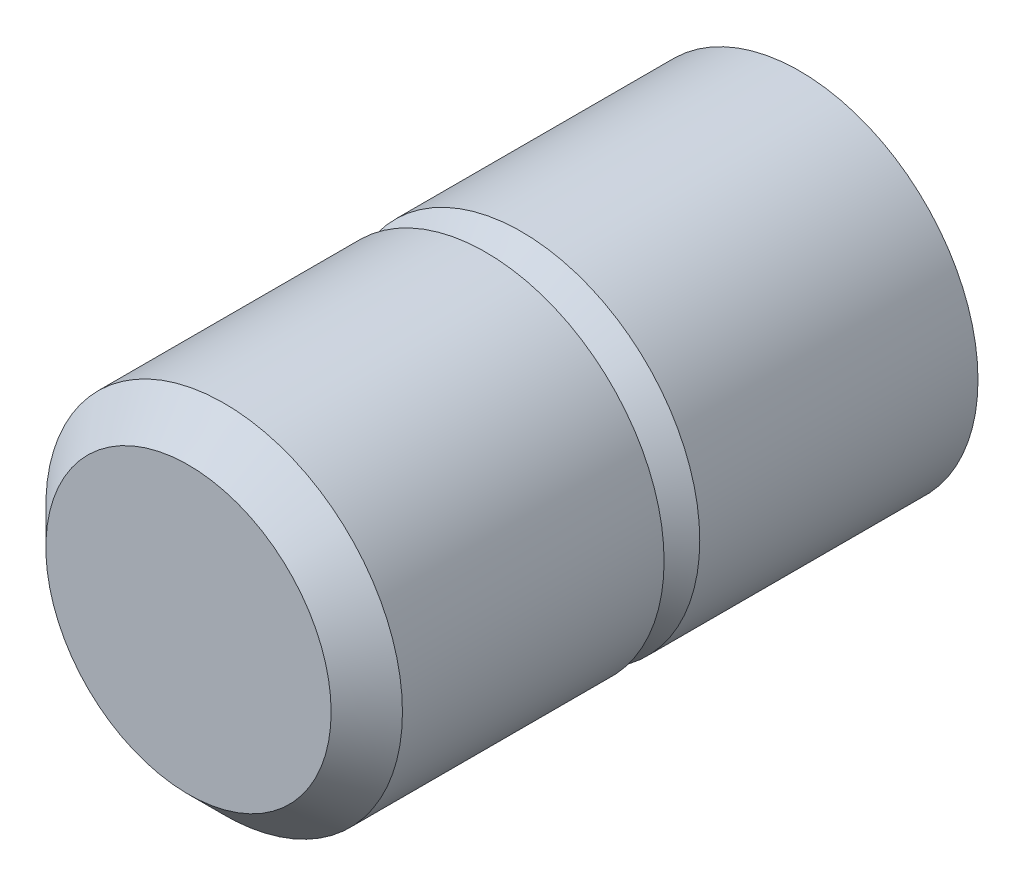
ISO-10303-21;
HEADER;
FILE_DESCRIPTION(('STEP AP214'),'2;1');
FILE_NAME('part.step','',(''),(''),'','','');
FILE_SCHEMA(('AUTOMOTIVE_DESIGN { 1 0 10303 214 1 1 1 1 }'));
ENDSEC;
DATA;
#1=APPLICATION_CONTEXT('core data for automotive mechanical design processes');
#2=APPLICATION_PROTOCOL_DEFINITION('international standard','automotive_design',2000,#1);
#3=PRODUCT_CONTEXT('',#1,'mechanical');
#4=PRODUCT('Part','Part','',(#3));
#5=PRODUCT_RELATED_PRODUCT_CATEGORY('part','',(#4));
#6=PRODUCT_DEFINITION_FORMATION('','',#4);
#7=PRODUCT_DEFINITION_CONTEXT('part definition',#1,'design');
#8=PRODUCT_DEFINITION('design','',#6,#7);
#9=PRODUCT_DEFINITION_SHAPE('','',#8);
#10=(LENGTH_UNIT() NAMED_UNIT(*) SI_UNIT(.MILLI.,.METRE.));
#11=(NAMED_UNIT(*) PLANE_ANGLE_UNIT() SI_UNIT($,.RADIAN.));
#12=(NAMED_UNIT(*) SI_UNIT($,.STERADIAN.) SOLID_ANGLE_UNIT());
#13=UNCERTAINTY_MEASURE_WITH_UNIT(LENGTH_MEASURE(1.E-05),#10,'distance_accuracy_value','');
#14=(GEOMETRIC_REPRESENTATION_CONTEXT(3) GLOBAL_UNCERTAINTY_ASSIGNED_CONTEXT((#13)) GLOBAL_UNIT_ASSIGNED_CONTEXT((#10,
#11,#12)) REPRESENTATION_CONTEXT('',''));
#15=CARTESIAN_POINT('',(0.,0.,0.));
#16=DIRECTION('',(0.,0.,1.));
#17=DIRECTION('',(1.,0.,0.));
#18=AXIS2_PLACEMENT_3D('',#15,#16,#17);
#19=CARTESIAN_POINT('',(0.,0.,0.));
#20=DIRECTION('',(0.,0.,-1.));
#21=DIRECTION('',(-1.,0.,0.));
#22=AXIS2_PLACEMENT_3D('',#19,#20,#21);
#23=PLANE('',#22);
#24=CARTESIAN_POINT('',(0.,0.,0.));
#25=DIRECTION('',(0.,0.,1.));
#26=DIRECTION('',(1.,0.,0.));
#27=AXIS2_PLACEMENT_3D('',#24,#25,#26);
#28=CIRCLE('',#27,4.801616);
#29=CARTESIAN_POINT('',(4.801616,0.,0.));
#30=VERTEX_POINT('',#29);
#31=EDGE_CURVE('E10',#30,#30,#28,.T.);
#32=ORIENTED_EDGE('',*,*,#31,.T.);
#33=EDGE_LOOP('',(#32));
#34=FACE_BOUND('',#33,.T.);
#35=ADVANCED_FACE('F29',(#34),#23,.F.);
#36=CARTESIAN_POINT('',(0.,0.,-1.200404));
#37=DIRECTION('',(0.,0.,-1.));
#38=DIRECTION('',(-1.,0.,0.));
#39=AXIS2_PLACEMENT_3D('',#36,#37,#38);
#40=CONICAL_SURFACE('',#39,6.00202,0.785398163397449);
#41=ORIENTED_EDGE('',*,*,#31,.F.);
#42=EDGE_LOOP('',(#41));
#43=FACE_BOUND('',#42,.T.);
#44=CARTESIAN_POINT('',(0.,0.,-1.200404));
#45=DIRECTION('',(0.,0.,1.));
#46=DIRECTION('',(1.,0.,0.));
#47=AXIS2_PLACEMENT_3D('',#44,#45,#46);
#48=CIRCLE('',#47,6.00202);
#49=CARTESIAN_POINT('',(6.00202,0.,-1.200404));
#50=VERTEX_POINT('',#49);
#51=EDGE_CURVE('E35',#50,#50,#48,.T.);
#52=ORIENTED_EDGE('',*,*,#51,.T.);
#53=EDGE_LOOP('',(#52));
#54=FACE_BOUND('',#53,.T.);
#55=ADVANCED_FACE('F67',(#43,#54),#40,.T.);
#56=CARTESIAN_POINT('',(0.,0.,0.));
#57=DIRECTION('',(0.,0.,1.));
#58=DIRECTION('',(1.,0.,0.));
#59=AXIS2_PLACEMENT_3D('',#56,#57,#58);
#60=CYLINDRICAL_SURFACE('',#59,6.00202);
#61=ORIENTED_EDGE('',*,*,#51,.F.);
#62=EDGE_LOOP('',(#61));
#63=FACE_BOUND('',#62,.T.);
#64=CARTESIAN_POINT('',(0.,0.,-10.0076));
#65=DIRECTION('',(0.,0.,1.));
#66=DIRECTION('',(1.,0.,0.));
#67=AXIS2_PLACEMENT_3D('',#64,#65,#66);
#68=CIRCLE('',#67,6.00202);
#69=CARTESIAN_POINT('',(6.00202,0.,-10.0076));
#70=VERTEX_POINT('',#69);
#71=EDGE_CURVE('E39',#70,#70,#68,.T.);
#72=ORIENTED_EDGE('',*,*,#71,.T.);
#73=EDGE_LOOP('',(#72));
#74=FACE_BOUND('',#73,.T.);
#75=ADVANCED_FACE('F71',(#63,#74),#60,.T.);
#76=CARTESIAN_POINT('',(0.,6.00202,-10.0076));
#77=DIRECTION('',(0.,0.,1.));
#78=DIRECTION('',(1.,0.,0.));
#79=AXIS2_PLACEMENT_3D('',#76,#77,#78);
#80=PLANE('',#79);
#81=ORIENTED_EDGE('',*,*,#71,.F.);
#82=EDGE_LOOP('',(#81));
#83=FACE_BOUND('',#82,.T.);
#84=CARTESIAN_POINT('',(0.,0.,-10.0076));
#85=DIRECTION('',(0.,0.,1.));
#86=DIRECTION('',(1.,0.,0.));
#87=AXIS2_PLACEMENT_3D('',#84,#85,#86);
#88=CIRCLE('',#87,4.801616);
#89=CARTESIAN_POINT('',(4.801616,0.,-10.0076));
#90=VERTEX_POINT('',#89);
#91=EDGE_CURVE('E43',#90,#90,#88,.T.);
#92=ORIENTED_EDGE('',*,*,#91,.T.);
#93=EDGE_LOOP('',(#92));
#94=FACE_BOUND('',#93,.T.);
#95=ADVANCED_FACE('F76',(#83,#94),#80,.F.);
#96=CARTESIAN_POINT('',(0.,0.,-11.208004));
#97=DIRECTION('',(0.,0.,-1.));
#98=DIRECTION('',(-1.,0.,0.));
#99=AXIS2_PLACEMENT_3D('',#96,#97,#98);
#100=CONICAL_SURFACE('',#99,6.00202,0.785398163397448);
#101=ORIENTED_EDGE('',*,*,#91,.F.);
#102=EDGE_LOOP('',(#101));
#103=FACE_BOUND('',#102,.T.);
#104=CARTESIAN_POINT('',(0.,0.,-11.208004));
#105=DIRECTION('',(0.,0.,1.));
#106=DIRECTION('',(1.,0.,0.));
#107=AXIS2_PLACEMENT_3D('',#104,#105,#106);
#108=CIRCLE('',#107,6.00202);
#109=CARTESIAN_POINT('',(6.00202,0.,-11.208004));
#110=VERTEX_POINT('',#109);
#111=EDGE_CURVE('E48',#110,#110,#108,.T.);
#112=ORIENTED_EDGE('',*,*,#111,.T.);
#113=EDGE_LOOP('',(#112));
#114=FACE_BOUND('',#113,.T.);
#115=ADVANCED_FACE('F63',(#103,#114),#100,.T.);
#116=CARTESIAN_POINT('',(0.,0.,0.));
#117=DIRECTION('',(0.,0.,1.));
#118=DIRECTION('',(1.,0.,0.));
#119=AXIS2_PLACEMENT_3D('',#116,#117,#118);
#120=CYLINDRICAL_SURFACE('',#119,6.00202);
#121=ORIENTED_EDGE('',*,*,#111,.F.);
#122=EDGE_LOOP('',(#121));
#123=FACE_BOUND('',#122,.T.);
#124=CARTESIAN_POINT('',(0.,0.,-20.574));
#125=DIRECTION('',(0.,0.,1.));
#126=DIRECTION('',(1.,0.,0.));
#127=AXIS2_PLACEMENT_3D('',#124,#125,#126);
#128=CIRCLE('',#127,6.00202);
#129=CARTESIAN_POINT('',(6.00202,0.,-20.574));
#130=VERTEX_POINT('',#129);
#131=EDGE_CURVE('E51',#130,#130,#128,.T.);
#132=ORIENTED_EDGE('',*,*,#131,.T.);
#133=EDGE_LOOP('',(#132));
#134=FACE_BOUND('',#133,.T.);
#135=ADVANCED_FACE('F55',(#123,#134),#120,.T.);
#136=CARTESIAN_POINT('',(0.,6.00202,-20.574));
#137=DIRECTION('',(0.,0.,1.));
#138=DIRECTION('',(1.,0.,0.));
#139=AXIS2_PLACEMENT_3D('',#136,#137,#138);
#140=PLANE('',#139);
#141=ORIENTED_EDGE('',*,*,#131,.F.);
#142=EDGE_LOOP('',(#141));
#143=FACE_BOUND('',#142,.T.);
#144=ADVANCED_FACE('F57',(#143),#140,.F.);
#145=CLOSED_SHELL('',(#35,#55,#75,#95,#115,#135,#144));
#146=MANIFOLD_SOLID_BREP('B2',#145);
#147=ADVANCED_BREP_SHAPE_REPRESENTATION('',(#18,#146),#14);
#148=SHAPE_DEFINITION_REPRESENTATION(#9,#147);
ENDSEC;
END-ISO-10303-21;
